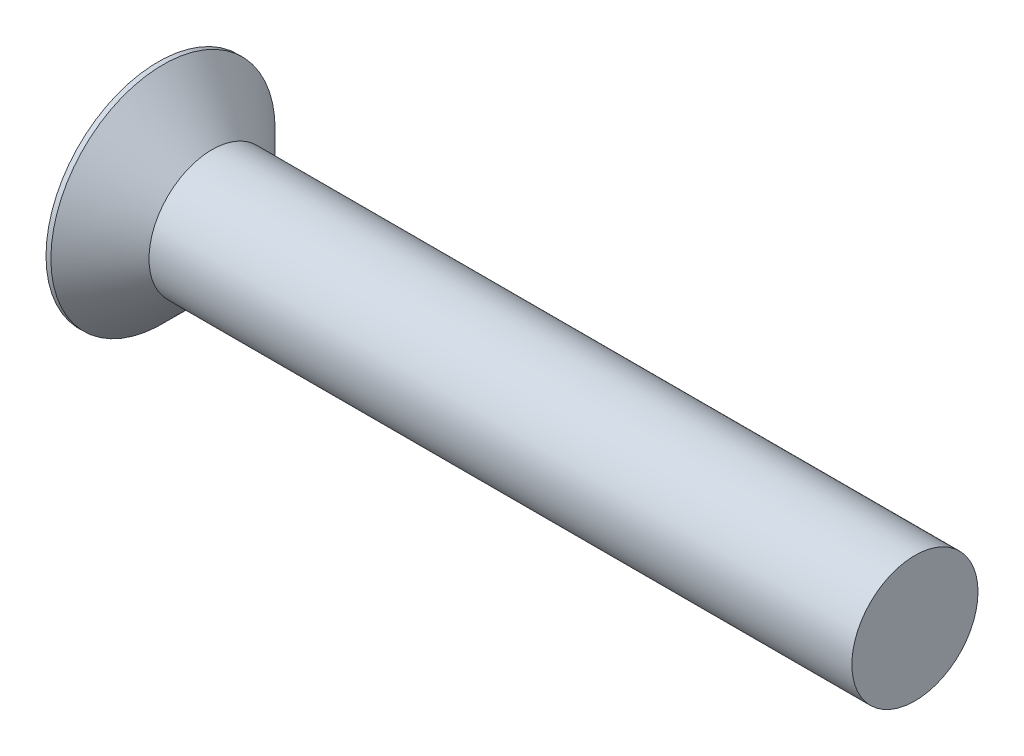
ISO-10303-21;
HEADER;
FILE_DESCRIPTION(('STEP AP214'),'2;1');
FILE_NAME('part.step','',(''),(''),'','','');
FILE_SCHEMA(('AUTOMOTIVE_DESIGN { 1 0 10303 214 1 1 1 1 }'));
ENDSEC;
DATA;
#1=APPLICATION_CONTEXT('core data for automotive mechanical design processes');
#2=APPLICATION_PROTOCOL_DEFINITION('international standard','automotive_design',2000,#1);
#3=PRODUCT_CONTEXT('',#1,'mechanical');
#4=PRODUCT('Part','Part','',(#3));
#5=PRODUCT_RELATED_PRODUCT_CATEGORY('part','',(#4));
#6=PRODUCT_DEFINITION_FORMATION('','',#4);
#7=PRODUCT_DEFINITION_CONTEXT('part definition',#1,'design');
#8=PRODUCT_DEFINITION('design','',#6,#7);
#9=PRODUCT_DEFINITION_SHAPE('','',#8);
#10=(LENGTH_UNIT() NAMED_UNIT(*) SI_UNIT(.MILLI.,.METRE.));
#11=(NAMED_UNIT(*) PLANE_ANGLE_UNIT() SI_UNIT($,.RADIAN.));
#12=(NAMED_UNIT(*) SI_UNIT($,.STERADIAN.) SOLID_ANGLE_UNIT());
#13=UNCERTAINTY_MEASURE_WITH_UNIT(LENGTH_MEASURE(1.E-05),#10,'distance_accuracy_value','');
#14=(GEOMETRIC_REPRESENTATION_CONTEXT(3) GLOBAL_UNCERTAINTY_ASSIGNED_CONTEXT((#13)) GLOBAL_UNIT_ASSIGNED_CONTEXT((#10,
#11,#12)) REPRESENTATION_CONTEXT('',''));
#15=CARTESIAN_POINT('',(0.,0.,0.));
#16=DIRECTION('',(0.,0.,1.));
#17=DIRECTION('',(1.,0.,0.));
#18=AXIS2_PLACEMENT_3D('',#15,#16,#17);
#19=CARTESIAN_POINT('',(60.,5.00000000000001,0.));
#20=DIRECTION('',(1.,0.,0.));
#21=DIRECTION('',(0.,0.,-1.));
#22=AXIS2_PLACEMENT_3D('',#19,#20,#21);
#23=PLANE('',#22);
#24=CARTESIAN_POINT('',(60.,0.,0.));
#25=DIRECTION('',(1.,0.,0.));
#26=DIRECTION('',(0.,0.,-1.));
#27=AXIS2_PLACEMENT_3D('',#24,#25,#26);
#28=CIRCLE('',#27,5.00000000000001);
#29=CARTESIAN_POINT('',(60.,0.,-5.00000000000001));
#30=VERTEX_POINT('',#29);
#31=EDGE_CURVE('E355',#30,#30,#28,.T.);
#32=ORIENTED_EDGE('',*,*,#31,.T.);
#33=EDGE_LOOP('',(#32));
#34=FACE_BOUND('',#33,.T.);
#35=ADVANCED_FACE('F35',(#34),#23,.T.);
#36=CARTESIAN_POINT('',(16.0308913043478,0.,0.));
#37=DIRECTION('',(0.,0.,1.));
#38=DIRECTION('',(1.,0.,0.));
#39=AXIS2_PLACEMENT_3D('',#36,#37,#38);
#40=SPHERICAL_SURFACE('',#39,18.3308913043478);
#41=CARTESIAN_POINT('',(14.3024985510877,-2.37436003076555,-4.11251220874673));
#42=DIRECTION('',(0.342020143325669,0.469846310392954,0.813797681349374));
#43=DIRECTION('',(0.,-0.866025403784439,0.5));
#44=AXIS2_PLACEMENT_3D('',#41,#42,#43);
#45=CIRCLE('',#44,17.6205531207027);
#46=CARTESIAN_POINT('',(-1.79199245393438,-3.03037873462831,3.03037873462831));
#47=VERTEX_POINT('',#46);
#48=CARTESIAN_POINT('',(-2.16161966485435,-1.,2.01348470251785));
#49=VERTEX_POINT('',#48);
#50=EDGE_CURVE('E327',#47,#49,#45,.F.);
#51=ORIENTED_EDGE('',*,*,#50,.F.);
#52=CARTESIAN_POINT('',(14.3024985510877,4.11251220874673,2.37436003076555));
#53=DIRECTION('',(0.342020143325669,-0.813797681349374,-0.469846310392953));
#54=DIRECTION('',(0.,0.499999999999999,-0.866025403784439));
#55=AXIS2_PLACEMENT_3D('',#52,#53,#54);
#56=CIRCLE('',#55,17.6205531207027);
#57=CARTESIAN_POINT('',(-2.16161966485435,-2.01348470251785,1.));
#58=VERTEX_POINT('',#57);
#59=EDGE_CURVE('E321',#58,#47,#56,.F.);
#60=ORIENTED_EDGE('',*,*,#59,.F.);
#61=CARTESIAN_POINT('',(16.0308913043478,0.,1.));
#62=DIRECTION('',(0.,0.,1.));
#63=DIRECTION('',(1.,0.,0.));
#64=AXIS2_PLACEMENT_3D('',#61,#62,#63);
#65=CIRCLE('',#64,18.3035946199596);
#66=CARTESIAN_POINT('',(-1.67502992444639,-4.63917335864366,1.));
#67=VERTEX_POINT('',#66);
#68=EDGE_CURVE('E386',#67,#58,#65,.F.);
#69=ORIENTED_EDGE('',*,*,#68,.F.);
#70=CARTESIAN_POINT('',(13.613231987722,4.18750877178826,0.));
#71=DIRECTION('',(-0.500000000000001,0.866025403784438,0.));
#72=DIRECTION('',(-0.866025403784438,-0.500000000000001,0.));
#73=AXIS2_PLACEMENT_3D('',#70,#71,#72);
#74=CIRCLE('',#73,17.6816647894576);
#75=CARTESIAN_POINT('',(-1.67502992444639,-4.63917335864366,-0.999999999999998));
#76=VERTEX_POINT('',#75);
#77=EDGE_CURVE('E390',#76,#67,#74,.T.);
#78=ORIENTED_EDGE('',*,*,#77,.F.);
#79=CARTESIAN_POINT('',(16.0308913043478,0.,-0.999999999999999));
#80=DIRECTION('',(0.,0.,-1.));
#81=DIRECTION('',(0.,1.,0.));
#82=AXIS2_PLACEMENT_3D('',#79,#80,#81);
#83=CIRCLE('',#82,18.3035946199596);
#84=CARTESIAN_POINT('',(-2.16161966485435,-2.01348470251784,-0.999999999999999));
#85=VERTEX_POINT('',#84);
#86=EDGE_CURVE('E376',#85,#76,#83,.F.);
#87=ORIENTED_EDGE('',*,*,#86,.F.);
#88=CARTESIAN_POINT('',(14.3024985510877,4.11251220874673,-2.37436003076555));
#89=DIRECTION('',(0.342020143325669,-0.813797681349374,0.469846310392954));
#90=DIRECTION('',(0.,-0.5,-0.866025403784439));
#91=AXIS2_PLACEMENT_3D('',#88,#89,#90);
#92=CIRCLE('',#91,17.6205531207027);
#93=CARTESIAN_POINT('',(-1.79199245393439,-3.03037873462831,-3.03037873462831));
#94=VERTEX_POINT('',#93);
#95=EDGE_CURVE('E315',#94,#85,#92,.F.);
#96=ORIENTED_EDGE('',*,*,#95,.F.);
#97=CARTESIAN_POINT('',(14.3024985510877,-2.37436003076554,4.11251220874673));
#98=DIRECTION('',(0.342020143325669,0.469846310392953,-0.813797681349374));
#99=DIRECTION('',(0.,0.866025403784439,0.499999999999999));
#100=AXIS2_PLACEMENT_3D('',#97,#98,#99);
#101=CIRCLE('',#100,17.6205531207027);
#102=CARTESIAN_POINT('',(-2.16161966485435,-1.,-2.01348470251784));
#103=VERTEX_POINT('',#102);
#104=EDGE_CURVE('E309',#103,#94,#101,.F.);
#105=ORIENTED_EDGE('',*,*,#104,.F.);
#106=CARTESIAN_POINT('',(16.0308913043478,-1.,0.));
#107=DIRECTION('',(0.,-1.,0.));
#108=DIRECTION('',(0.,0.,-1.));
#109=AXIS2_PLACEMENT_3D('',#106,#107,#108);
#110=CIRCLE('',#109,18.3035946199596);
#111=CARTESIAN_POINT('',(-1.67502992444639,-1.,-4.63917335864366));
#112=VERTEX_POINT('',#111);
#113=EDGE_CURVE('E373',#112,#103,#110,.F.);
#114=ORIENTED_EDGE('',*,*,#113,.F.);
#115=CARTESIAN_POINT('',(13.613231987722,0.,4.18750877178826));
#116=DIRECTION('',(-0.500000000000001,0.,0.866025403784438));
#117=DIRECTION('',(0.866025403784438,0.,0.500000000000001));
#118=AXIS2_PLACEMENT_3D('',#115,#116,#117);
#119=CIRCLE('',#118,17.6816647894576);
#120=CARTESIAN_POINT('',(-1.67502992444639,0.999999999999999,-4.63917335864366));
#121=VERTEX_POINT('',#120);
#122=EDGE_CURVE('E368',#121,#112,#119,.T.);
#123=ORIENTED_EDGE('',*,*,#122,.F.);
#124=CARTESIAN_POINT('',(16.0308913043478,1.,0.));
#125=DIRECTION('',(0.,1.,0.));
#126=DIRECTION('',(0.,0.,1.));
#127=AXIS2_PLACEMENT_3D('',#124,#125,#126);
#128=CIRCLE('',#127,18.3035946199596);
#129=CARTESIAN_POINT('',(-2.16161966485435,0.999999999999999,-2.01348470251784));
#130=VERTEX_POINT('',#129);
#131=EDGE_CURVE('E369',#130,#121,#128,.F.);
#132=ORIENTED_EDGE('',*,*,#131,.F.);
#133=CARTESIAN_POINT('',(14.3024985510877,2.37436003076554,4.11251220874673));
#134=DIRECTION('',(0.342020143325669,-0.469846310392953,-0.813797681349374));
#135=DIRECTION('',(0.,0.866025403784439,-0.499999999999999));
#136=AXIS2_PLACEMENT_3D('',#133,#134,#135);
#137=CIRCLE('',#136,17.6205531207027);
#138=CARTESIAN_POINT('',(-1.79199245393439,3.03037873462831,-3.0303787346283));
#139=VERTEX_POINT('',#138);
#140=EDGE_CURVE('E303',#139,#130,#137,.F.);
#141=ORIENTED_EDGE('',*,*,#140,.F.);
#142=CARTESIAN_POINT('',(14.3024985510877,-4.11251220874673,-2.37436003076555));
#143=DIRECTION('',(0.342020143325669,0.813797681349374,0.469846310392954));
#144=DIRECTION('',(0.,-0.5,0.866025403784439));
#145=AXIS2_PLACEMENT_3D('',#142,#143,#144);
#146=CIRCLE('',#145,17.6205531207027);
#147=CARTESIAN_POINT('',(-2.16161966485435,2.01348470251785,-1.));
#148=VERTEX_POINT('',#147);
#149=EDGE_CURVE('E297',#148,#139,#146,.F.);
#150=ORIENTED_EDGE('',*,*,#149,.F.);
#151=CARTESIAN_POINT('',(16.0308913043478,0.,-1.));
#152=DIRECTION('',(0.,0.,-1.));
#153=DIRECTION('',(0.,1.,0.));
#154=AXIS2_PLACEMENT_3D('',#151,#152,#153);
#155=CIRCLE('',#154,18.3035946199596);
#156=CARTESIAN_POINT('',(-1.67502992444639,4.63917335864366,-1.));
#157=VERTEX_POINT('',#156);
#158=EDGE_CURVE('E372',#157,#148,#155,.F.);
#159=ORIENTED_EDGE('',*,*,#158,.F.);
#160=CARTESIAN_POINT('',(13.613231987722,-4.18750877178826,0.));
#161=DIRECTION('',(-0.500000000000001,-0.866025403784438,0.));
#162=DIRECTION('',(0.866025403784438,-0.500000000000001,0.));
#163=AXIS2_PLACEMENT_3D('',#160,#161,#162);
#164=CIRCLE('',#163,17.6816647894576);
#165=CARTESIAN_POINT('',(-1.67502992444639,4.63917335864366,1.));
#166=VERTEX_POINT('',#165);
#167=EDGE_CURVE('E379',#166,#157,#164,.T.);
#168=ORIENTED_EDGE('',*,*,#167,.F.);
#169=CARTESIAN_POINT('',(16.0308913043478,0.,1.));
#170=DIRECTION('',(0.,0.,1.));
#171=DIRECTION('',(1.,0.,0.));
#172=AXIS2_PLACEMENT_3D('',#169,#170,#171);
#173=CIRCLE('',#172,18.3035946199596);
#174=CARTESIAN_POINT('',(-2.16161966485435,2.01348470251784,1.));
#175=VERTEX_POINT('',#174);
#176=EDGE_CURVE('E377',#175,#166,#173,.F.);
#177=ORIENTED_EDGE('',*,*,#176,.F.);
#178=CARTESIAN_POINT('',(14.3024985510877,-4.11251220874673,2.37436003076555));
#179=DIRECTION('',(0.342020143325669,0.813797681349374,-0.469846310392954));
#180=DIRECTION('',(0.,0.5,0.866025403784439));
#181=AXIS2_PLACEMENT_3D('',#178,#179,#180);
#182=CIRCLE('',#181,17.6205531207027);
#183=CARTESIAN_POINT('',(-1.79199245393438,3.03037873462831,3.03037873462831));
#184=VERTEX_POINT('',#183);
#185=EDGE_CURVE('E291',#184,#175,#182,.F.);
#186=ORIENTED_EDGE('',*,*,#185,.F.);
#187=CARTESIAN_POINT('',(14.3024985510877,2.37436003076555,-4.11251220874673));
#188=DIRECTION('',(0.342020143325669,-0.469846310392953,0.813797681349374));
#189=DIRECTION('',(0.,-0.866025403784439,-0.499999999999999));
#190=AXIS2_PLACEMENT_3D('',#187,#188,#189);
#191=CIRCLE('',#190,17.6205531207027);
#192=CARTESIAN_POINT('',(-2.16161966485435,1.,2.01348470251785));
#193=VERTEX_POINT('',#192);
#194=EDGE_CURVE('E283',#193,#184,#191,.F.);
#195=ORIENTED_EDGE('',*,*,#194,.F.);
#196=CARTESIAN_POINT('',(16.0308913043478,1.,0.));
#197=DIRECTION('',(0.,1.,0.));
#198=DIRECTION('',(0.,0.,1.));
#199=AXIS2_PLACEMENT_3D('',#196,#197,#198);
#200=CIRCLE('',#199,18.3035946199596);
#201=CARTESIAN_POINT('',(-1.67502992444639,1.,4.63917335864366));
#202=VERTEX_POINT('',#201);
#203=EDGE_CURVE('E380',#202,#193,#200,.F.);
#204=ORIENTED_EDGE('',*,*,#203,.F.);
#205=CARTESIAN_POINT('',(13.613231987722,0.,-4.18750877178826));
#206=DIRECTION('',(-0.500000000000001,0.,-0.866025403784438));
#207=DIRECTION('',(-0.866025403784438,0.,0.500000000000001));
#208=AXIS2_PLACEMENT_3D('',#205,#206,#207);
#209=CIRCLE('',#208,17.6816647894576);
#210=CARTESIAN_POINT('',(-1.67502992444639,-1.,4.63917335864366));
#211=VERTEX_POINT('',#210);
#212=EDGE_CURVE('E385',#211,#202,#209,.T.);
#213=ORIENTED_EDGE('',*,*,#212,.F.);
#214=CARTESIAN_POINT('',(16.0308913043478,-1.,0.));
#215=DIRECTION('',(0.,-1.,0.));
#216=DIRECTION('',(0.,0.,-1.));
#217=AXIS2_PLACEMENT_3D('',#214,#215,#216);
#218=CIRCLE('',#217,18.3035946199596);
#219=EDGE_CURVE('E383',#49,#211,#218,.F.);
#220=ORIENTED_EDGE('',*,*,#219,.F.);
#221=EDGE_LOOP('',(#51,#60,#69,#78,#87,#96,#105,#114,#123,#132,#141,#150,#159,#168,#177,#186,
#195,#204,#213,#220));
#222=FACE_BOUND('',#221,.T.);
#223=CARTESIAN_POINT('',(0.,0.,0.));
#224=DIRECTION('',(1.,0.,0.));
#225=DIRECTION('',(0.,0.,-1.));
#226=AXIS2_PLACEMENT_3D('',#223,#224,#225);
#227=CIRCLE('',#226,8.89);
#228=CARTESIAN_POINT('',(0.,0.,-8.89));
#229=VERTEX_POINT('',#228);
#230=EDGE_CURVE('E365',#229,#229,#227,.T.);
#231=ORIENTED_EDGE('',*,*,#230,.F.);
#232=EDGE_LOOP('',(#231));
#233=FACE_BOUND('',#232,.T.);
#234=ADVANCED_FACE('F547',(#222,#233),#40,.T.);
#235=CARTESIAN_POINT('',(4.51581291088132,0.,0.));
#236=DIRECTION('',(1.,0.,0.));
#237=DIRECTION('',(0.,0.,-1.));
#238=AXIS2_PLACEMENT_3D('',#235,#236,#237);
#239=CYLINDRICAL_SURFACE('',#238,8.89);
#240=ORIENTED_EDGE('',*,*,#230,.T.);
#241=EDGE_LOOP('',(#240));
#242=FACE_BOUND('',#241,.T.);
#243=CARTESIAN_POINT('',(0.385867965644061,0.,0.));
#244=DIRECTION('',(1.,0.,0.));
#245=DIRECTION('',(0.,0.,-1.));
#246=AXIS2_PLACEMENT_3D('',#243,#244,#245);
#247=CIRCLE('',#246,8.88999999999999);
#248=CARTESIAN_POINT('',(0.385867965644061,0.,-8.88999999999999));
#249=VERTEX_POINT('',#248);
#250=EDGE_CURVE('E362',#249,#249,#247,.T.);
#251=ORIENTED_EDGE('',*,*,#250,.F.);
#252=EDGE_LOOP('',(#251));
#253=FACE_BOUND('',#252,.T.);
#254=ADVANCED_FACE('F579',(#242,#253),#239,.T.);
#255=CARTESIAN_POINT('',(4.27586796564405,0.,0.));
#256=DIRECTION('',(-1.,0.,0.));
#257=DIRECTION('',(0.,0.,1.));
#258=AXIS2_PLACEMENT_3D('',#255,#256,#257);
#259=CONICAL_SURFACE('',#258,4.99999999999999,0.78539816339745);
#260=ORIENTED_EDGE('',*,*,#250,.T.);
#261=EDGE_LOOP('',(#260));
#262=FACE_BOUND('',#261,.T.);
#263=CARTESIAN_POINT('',(4.27586796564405,0.,0.));
#264=DIRECTION('',(1.,0.,0.));
#265=DIRECTION('',(0.,0.,-1.));
#266=AXIS2_PLACEMENT_3D('',#263,#264,#265);
#267=CIRCLE('',#266,4.99999999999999);
#268=CARTESIAN_POINT('',(4.27586796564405,0.,-4.99999999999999));
#269=VERTEX_POINT('',#268);
#270=EDGE_CURVE('E358',#269,#269,#267,.T.);
#271=ORIENTED_EDGE('',*,*,#270,.F.);
#272=EDGE_LOOP('',(#271));
#273=FACE_BOUND('',#272,.T.);
#274=ADVANCED_FACE('F743',(#262,#273),#259,.T.);
#275=CARTESIAN_POINT('',(4.51581291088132,0.,0.));
#276=DIRECTION('',(1.,0.,0.));
#277=DIRECTION('',(0.,0.,-1.));
#278=AXIS2_PLACEMENT_3D('',#275,#276,#277);
#279=CYLINDRICAL_SURFACE('',#278,5.);
#280=ORIENTED_EDGE('',*,*,#270,.T.);
#281=EDGE_LOOP('',(#280));
#282=FACE_BOUND('',#281,.T.);
#283=ORIENTED_EDGE('',*,*,#31,.F.);
#284=EDGE_LOOP('',(#283));
#285=FACE_BOUND('',#284,.T.);
#286=ADVANCED_FACE('F741',(#282,#285),#279,.T.);
#287=CARTESIAN_POINT('',(0.2,1.,-1.));
#288=DIRECTION('',(0.,1.,0.));
#289=DIRECTION('',(0.,0.,1.));
#290=AXIS2_PLACEMENT_3D('',#287,#288,#289);
#291=PLANE('',#290);
#292=DIRECTION('',(-1.,0.,0.));
#293=VECTOR('',#292,1.);
#294=CARTESIAN_POINT('',(0.2,1.,-1.3));
#295=LINE('',#294,#293);
#296=CARTESIAN_POINT('',(0.2,1.,-1.3));
#297=VERTEX_POINT('',#296);
#298=CARTESIAN_POINT('',(-0.463964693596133,1.,-1.3));
#299=VERTEX_POINT('',#298);
#300=EDGE_CURVE('E436',#297,#299,#295,.T.);
#301=ORIENTED_EDGE('',*,*,#300,.T.);
#302=DIRECTION('',(-0.921891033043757,0.,-0.387449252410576));
#303=VECTOR('',#302,1.);
#304=CARTESIAN_POINT('',(0.207483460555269,1.,-1.01780603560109));
#305=LINE('',#304,#303);
#306=EDGE_CURVE('E300',#299,#130,#305,.T.);
#307=ORIENTED_EDGE('',*,*,#306,.T.);
#308=ORIENTED_EDGE('',*,*,#131,.T.);
#309=DIRECTION('',(0.866025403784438,0.,0.500000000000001));
#310=VECTOR('',#309,1.);
#311=CARTESIAN_POINT('',(1.30705080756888,0.999999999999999,-2.91746824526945));
#312=LINE('',#311,#310);
#313=CARTESIAN_POINT('',(0.2,0.999999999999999,-3.55662432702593));
#314=VERTEX_POINT('',#313);
#315=EDGE_CURVE('E354',#314,#121,#312,.F.);
#316=ORIENTED_EDGE('',*,*,#315,.F.);
#317=DIRECTION('',(0.,0.,-1.));
#318=VECTOR('',#317,1.);
#319=CARTESIAN_POINT('',(0.2,1.,-1.));
#320=LINE('',#319,#318);
#321=EDGE_CURVE('E330',#297,#314,#320,.T.);
#322=ORIENTED_EDGE('',*,*,#321,.F.);
#323=EDGE_LOOP('',(#301,#307,#308,#316,#322));
#324=FACE_BOUND('',#323,.T.);
#325=ADVANCED_FACE('F521',(#324),#291,.F.);
#326=CARTESIAN_POINT('',(0.2,1.,-1.));
#327=DIRECTION('',(0.,0.,-1.));
#328=DIRECTION('',(0.,1.,0.));
#329=AXIS2_PLACEMENT_3D('',#326,#327,#328);
#330=PLANE('',#329);
#331=ORIENTED_EDGE('',*,*,#158,.T.);
#332=DIRECTION('',(0.921891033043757,-0.387449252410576,0.));
#333=VECTOR('',#332,1.);
#334=CARTESIAN_POINT('',(0.207483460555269,1.01780603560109,-1.));
#335=LINE('',#334,#333);
#336=CARTESIAN_POINT('',(-0.463964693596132,1.3,-1.));
#337=VERTEX_POINT('',#336);
#338=EDGE_CURVE('E294',#148,#337,#335,.T.);
#339=ORIENTED_EDGE('',*,*,#338,.T.);
#340=DIRECTION('',(-1.,0.,0.));
#341=VECTOR('',#340,1.);
#342=CARTESIAN_POINT('',(0.2,1.3,-1.));
#343=LINE('',#342,#341);
#344=CARTESIAN_POINT('',(0.2,1.3,-1.));
#345=VERTEX_POINT('',#344);
#346=EDGE_CURVE('E439',#337,#345,#343,.F.);
#347=ORIENTED_EDGE('',*,*,#346,.T.);
#348=DIRECTION('',(0.,-1.,0.));
#349=VECTOR('',#348,1.);
#350=CARTESIAN_POINT('',(0.2,1.,-1.));
#351=LINE('',#350,#349);
#352=CARTESIAN_POINT('',(0.2,3.55662432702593,-1.));
#353=VERTEX_POINT('',#352);
#354=EDGE_CURVE('E351',#353,#345,#351,.T.);
#355=ORIENTED_EDGE('',*,*,#354,.F.);
#356=DIRECTION('',(0.866025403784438,-0.500000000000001,0.));
#357=VECTOR('',#356,1.);
#358=CARTESIAN_POINT('',(-2.3,5.,-1.));
#359=LINE('',#358,#357);
#360=EDGE_CURVE('E359',#353,#157,#359,.F.);
#361=ORIENTED_EDGE('',*,*,#360,.T.);
#362=EDGE_LOOP('',(#331,#339,#347,#355,#361));
#363=FACE_BOUND('',#362,.T.);
#364=ADVANCED_FACE('F510',(#363),#330,.F.);
#365=CARTESIAN_POINT('',(-2.3,5.,0.));
#366=DIRECTION('',(-0.500000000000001,-0.866025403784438,0.));
#367=DIRECTION('',(0.866025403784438,-0.500000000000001,0.));
#368=AXIS2_PLACEMENT_3D('',#365,#366,#367);
#369=PLANE('',#368);
#370=ORIENTED_EDGE('',*,*,#167,.T.);
#371=ORIENTED_EDGE('',*,*,#360,.F.);
#372=DIRECTION('',(0.,0.,1.));
#373=VECTOR('',#372,1.);
#374=CARTESIAN_POINT('',(0.2,3.55662432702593,-1.));
#375=LINE('',#374,#373);
#376=CARTESIAN_POINT('',(0.2,3.55662432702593,1.));
#377=VERTEX_POINT('',#376);
#378=EDGE_CURVE('E350',#377,#353,#375,.F.);
#379=ORIENTED_EDGE('',*,*,#378,.F.);
#380=DIRECTION('',(0.866025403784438,-0.500000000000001,0.));
#381=VECTOR('',#380,1.);
#382=CARTESIAN_POINT('',(1.30705080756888,2.91746824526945,1.));
#383=LINE('',#382,#381);
#384=EDGE_CURVE('E403',#377,#166,#383,.F.);
#385=ORIENTED_EDGE('',*,*,#384,.T.);
#386=EDGE_LOOP('',(#370,#371,#379,#385));
#387=FACE_BOUND('',#386,.T.);
#388=ADVANCED_FACE('F591',(#387),#369,.T.);
#389=CARTESIAN_POINT('',(0.2,1.,1.));
#390=DIRECTION('',(0.,0.,1.));
#391=DIRECTION('',(1.,0.,0.));
#392=AXIS2_PLACEMENT_3D('',#389,#390,#391);
#393=PLANE('',#392);
#394=DIRECTION('',(-1.,0.,0.));
#395=VECTOR('',#394,1.);
#396=CARTESIAN_POINT('',(0.2,1.3,1.));
#397=LINE('',#396,#395);
#398=CARTESIAN_POINT('',(0.2,1.3,1.));
#399=VERTEX_POINT('',#398);
#400=CARTESIAN_POINT('',(-0.463964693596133,1.3,1.));
#401=VERTEX_POINT('',#400);
#402=EDGE_CURVE('E441',#399,#401,#397,.T.);
#403=ORIENTED_EDGE('',*,*,#402,.T.);
#404=DIRECTION('',(-0.921891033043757,0.387449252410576,0.));
#405=VECTOR('',#404,1.);
#406=CARTESIAN_POINT('',(0.207483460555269,1.01780603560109,1.));
#407=LINE('',#406,#405);
#408=EDGE_CURVE('E288',#401,#175,#407,.T.);
#409=ORIENTED_EDGE('',*,*,#408,.T.);
#410=ORIENTED_EDGE('',*,*,#176,.T.);
#411=ORIENTED_EDGE('',*,*,#384,.F.);
#412=DIRECTION('',(0.,1.,0.));
#413=VECTOR('',#412,1.);
#414=CARTESIAN_POINT('',(0.2,1.,1.));
#415=LINE('',#414,#413);
#416=EDGE_CURVE('E348',#399,#377,#415,.T.);
#417=ORIENTED_EDGE('',*,*,#416,.F.);
#418=EDGE_LOOP('',(#403,#409,#410,#411,#417));
#419=FACE_BOUND('',#418,.T.);
#420=ADVANCED_FACE('F502',(#419),#393,.F.);
#421=CARTESIAN_POINT('',(0.2,1.,1.));
#422=DIRECTION('',(0.,1.,0.));
#423=DIRECTION('',(0.,0.,1.));
#424=AXIS2_PLACEMENT_3D('',#421,#422,#423);
#425=PLANE('',#424);
#426=ORIENTED_EDGE('',*,*,#203,.T.);
#427=DIRECTION('',(0.921891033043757,0.,-0.387449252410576));
#428=VECTOR('',#427,1.);
#429=CARTESIAN_POINT('',(0.207483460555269,1.,1.01780603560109));
#430=LINE('',#429,#428);
#431=CARTESIAN_POINT('',(-0.463964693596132,1.,1.3));
#432=VERTEX_POINT('',#431);
#433=EDGE_CURVE('E280',#193,#432,#430,.T.);
#434=ORIENTED_EDGE('',*,*,#433,.T.);
#435=DIRECTION('',(-1.,0.,0.));
#436=VECTOR('',#435,1.);
#437=CARTESIAN_POINT('',(0.2,1.,1.3));
#438=LINE('',#437,#436);
#439=CARTESIAN_POINT('',(0.2,1.,1.3));
#440=VERTEX_POINT('',#439);
#441=EDGE_CURVE('E444',#432,#440,#438,.F.);
#442=ORIENTED_EDGE('',*,*,#441,.T.);
#443=DIRECTION('',(0.,0.,-1.));
#444=VECTOR('',#443,1.);
#445=CARTESIAN_POINT('',(0.2,1.,1.));
#446=LINE('',#445,#444);
#447=CARTESIAN_POINT('',(0.2,1.,3.55662432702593));
#448=VERTEX_POINT('',#447);
#449=EDGE_CURVE('E345',#448,#440,#446,.T.);
#450=ORIENTED_EDGE('',*,*,#449,.F.);
#451=DIRECTION('',(0.866025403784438,0.,-0.500000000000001));
#452=VECTOR('',#451,1.);
#453=CARTESIAN_POINT('',(-2.3,1.,5.));
#454=LINE('',#453,#452);
#455=EDGE_CURVE('E406',#448,#202,#454,.F.);
#456=ORIENTED_EDGE('',*,*,#455,.T.);
#457=EDGE_LOOP('',(#426,#434,#442,#450,#456));
#458=FACE_BOUND('',#457,.T.);
#459=ADVANCED_FACE('F553',(#458),#425,.F.);
#460=CARTESIAN_POINT('',(-2.3,0.,5.));
#461=DIRECTION('',(-0.500000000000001,0.,-0.866025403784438));
#462=DIRECTION('',(-0.866025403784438,0.,0.500000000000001));
#463=AXIS2_PLACEMENT_3D('',#460,#461,#462);
#464=PLANE('',#463);
#465=ORIENTED_EDGE('',*,*,#212,.T.);
#466=ORIENTED_EDGE('',*,*,#455,.F.);
#467=DIRECTION('',(0.,-1.,0.));
#468=VECTOR('',#467,1.);
#469=CARTESIAN_POINT('',(0.2,1.,3.55662432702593));
#470=LINE('',#469,#468);
#471=CARTESIAN_POINT('',(0.2,-1.,3.55662432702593));
#472=VERTEX_POINT('',#471);
#473=EDGE_CURVE('E344',#472,#448,#470,.F.);
#474=ORIENTED_EDGE('',*,*,#473,.F.);
#475=DIRECTION('',(0.866025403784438,0.,-0.500000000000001));
#476=VECTOR('',#475,1.);
#477=CARTESIAN_POINT('',(1.30705080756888,-1.,2.91746824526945));
#478=LINE('',#477,#476);
#479=EDGE_CURVE('E412',#472,#211,#478,.F.);
#480=ORIENTED_EDGE('',*,*,#479,.T.);
#481=EDGE_LOOP('',(#465,#466,#474,#480));
#482=FACE_BOUND('',#481,.T.);
#483=ADVANCED_FACE('F491',(#482),#464,.T.);
#484=CARTESIAN_POINT('',(0.2,-1.,1.));
#485=DIRECTION('',(0.,-1.,0.));
#486=DIRECTION('',(0.,0.,-1.));
#487=AXIS2_PLACEMENT_3D('',#484,#485,#486);
#488=PLANE('',#487);
#489=DIRECTION('',(-1.,0.,0.));
#490=VECTOR('',#489,1.);
#491=CARTESIAN_POINT('',(0.2,-1.,1.3));
#492=LINE('',#491,#490);
#493=CARTESIAN_POINT('',(0.2,-1.,1.3));
#494=VERTEX_POINT('',#493);
#495=CARTESIAN_POINT('',(-0.463964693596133,-1.,1.3));
#496=VERTEX_POINT('',#495);
#497=EDGE_CURVE('E371',#494,#496,#492,.T.);
#498=ORIENTED_EDGE('',*,*,#497,.T.);
#499=DIRECTION('',(-0.921891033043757,0.,0.387449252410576));
#500=VECTOR('',#499,1.);
#501=CARTESIAN_POINT('',(0.207483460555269,-1.,1.01780603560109));
#502=LINE('',#501,#500);
#503=EDGE_CURVE('E324',#496,#49,#502,.T.);
#504=ORIENTED_EDGE('',*,*,#503,.T.);
#505=ORIENTED_EDGE('',*,*,#219,.T.);
#506=ORIENTED_EDGE('',*,*,#479,.F.);
#507=DIRECTION('',(0.,0.,1.));
#508=VECTOR('',#507,1.);
#509=CARTESIAN_POINT('',(0.2,-1.,1.));
#510=LINE('',#509,#508);
#511=EDGE_CURVE('E342',#494,#472,#510,.T.);
#512=ORIENTED_EDGE('',*,*,#511,.F.);
#513=EDGE_LOOP('',(#498,#504,#505,#506,#512));
#514=FACE_BOUND('',#513,.T.);
#515=ADVANCED_FACE('F486',(#514),#488,.F.);
#516=CARTESIAN_POINT('',(0.2,-1.,1.));
#517=DIRECTION('',(0.,0.,1.));
#518=DIRECTION('',(1.,0.,0.));
#519=AXIS2_PLACEMENT_3D('',#516,#517,#518);
#520=PLANE('',#519);
#521=ORIENTED_EDGE('',*,*,#68,.T.);
#522=DIRECTION('',(0.921891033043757,0.387449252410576,0.));
#523=VECTOR('',#522,1.);
#524=CARTESIAN_POINT('',(0.207483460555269,-1.01780603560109,1.));
#525=LINE('',#524,#523);
#526=CARTESIAN_POINT('',(-0.463964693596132,-1.3,1.));
#527=VERTEX_POINT('',#526);
#528=EDGE_CURVE('E318',#58,#527,#525,.T.);
#529=ORIENTED_EDGE('',*,*,#528,.T.);
#530=DIRECTION('',(-1.,0.,0.));
#531=VECTOR('',#530,1.);
#532=CARTESIAN_POINT('',(0.2,-1.3,1.));
#533=LINE('',#532,#531);
#534=CARTESIAN_POINT('',(0.2,-1.3,1.));
#535=VERTEX_POINT('',#534);
#536=EDGE_CURVE('E429',#527,#535,#533,.F.);
#537=ORIENTED_EDGE('',*,*,#536,.T.);
#538=DIRECTION('',(0.,1.,0.));
#539=VECTOR('',#538,1.);
#540=CARTESIAN_POINT('',(0.2,-1.,1.));
#541=LINE('',#540,#539);
#542=CARTESIAN_POINT('',(0.2,-3.55662432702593,1.));
#543=VERTEX_POINT('',#542);
#544=EDGE_CURVE('E339',#543,#535,#541,.T.);
#545=ORIENTED_EDGE('',*,*,#544,.F.);
#546=DIRECTION('',(0.866025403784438,0.500000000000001,0.));
#547=VECTOR('',#546,1.);
#548=CARTESIAN_POINT('',(-2.3,-5.,1.));
#549=LINE('',#548,#547);
#550=EDGE_CURVE('E415',#543,#67,#549,.F.);
#551=ORIENTED_EDGE('',*,*,#550,.T.);
#552=EDGE_LOOP('',(#521,#529,#537,#545,#551));
#553=FACE_BOUND('',#552,.T.);
#554=ADVANCED_FACE('F475',(#553),#520,.F.);
#555=CARTESIAN_POINT('',(-2.3,-5.,0.));
#556=DIRECTION('',(-0.500000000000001,0.866025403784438,0.));
#557=DIRECTION('',(-0.866025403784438,-0.500000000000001,0.));
#558=AXIS2_PLACEMENT_3D('',#555,#556,#557);
#559=PLANE('',#558);
#560=ORIENTED_EDGE('',*,*,#77,.T.);
#561=ORIENTED_EDGE('',*,*,#550,.F.);
#562=DIRECTION('',(0.,0.,-1.));
#563=VECTOR('',#562,1.);
#564=CARTESIAN_POINT('',(0.2,-3.55662432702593,-1.));
#565=LINE('',#564,#563);
#566=CARTESIAN_POINT('',(0.2,-3.55662432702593,-0.999999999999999));
#567=VERTEX_POINT('',#566);
#568=EDGE_CURVE('E338',#567,#543,#565,.F.);
#569=ORIENTED_EDGE('',*,*,#568,.F.);
#570=DIRECTION('',(0.866025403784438,0.500000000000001,0.));
#571=VECTOR('',#570,1.);
#572=CARTESIAN_POINT('',(1.30705080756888,-2.91746824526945,-0.999999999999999));
#573=LINE('',#572,#571);
#574=EDGE_CURVE('E401',#567,#76,#573,.F.);
#575=ORIENTED_EDGE('',*,*,#574,.T.);
#576=EDGE_LOOP('',(#560,#561,#569,#575));
#577=FACE_BOUND('',#576,.T.);
#578=ADVANCED_FACE('F543',(#577),#559,.T.);
#579=CARTESIAN_POINT('',(0.2,-1.,-0.999999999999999));
#580=DIRECTION('',(0.,0.,-1.));
#581=DIRECTION('',(0.,1.,0.));
#582=AXIS2_PLACEMENT_3D('',#579,#580,#581);
#583=PLANE('',#582);
#584=DIRECTION('',(-1.,0.,0.));
#585=VECTOR('',#584,1.);
#586=CARTESIAN_POINT('',(0.2,-1.3,-0.999999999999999));
#587=LINE('',#586,#585);
#588=CARTESIAN_POINT('',(0.2,-1.3,-0.999999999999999));
#589=VERTEX_POINT('',#588);
#590=CARTESIAN_POINT('',(-0.463964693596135,-1.3,-0.999999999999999));
#591=VERTEX_POINT('',#590);
#592=EDGE_CURVE('E431',#589,#591,#587,.T.);
#593=ORIENTED_EDGE('',*,*,#592,.T.);
#594=DIRECTION('',(-0.921891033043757,-0.387449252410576,0.));
#595=VECTOR('',#594,1.);
#596=CARTESIAN_POINT('',(0.207483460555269,-1.01780603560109,-0.999999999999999));
#597=LINE('',#596,#595);
#598=EDGE_CURVE('E312',#591,#85,#597,.T.);
#599=ORIENTED_EDGE('',*,*,#598,.T.);
#600=ORIENTED_EDGE('',*,*,#86,.T.);
#601=ORIENTED_EDGE('',*,*,#574,.F.);
#602=DIRECTION('',(0.,-1.,0.));
#603=VECTOR('',#602,1.);
#604=CARTESIAN_POINT('',(0.2,-1.,-0.999999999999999));
#605=LINE('',#604,#603);
#606=EDGE_CURVE('E336',#589,#567,#605,.T.);
#607=ORIENTED_EDGE('',*,*,#606,.F.);
#608=EDGE_LOOP('',(#593,#599,#600,#601,#607));
#609=FACE_BOUND('',#608,.T.);
#610=ADVANCED_FACE('F538',(#609),#583,.F.);
#611=CARTESIAN_POINT('',(0.2,-1.,-0.999999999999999));
#612=DIRECTION('',(0.,-1.,0.));
#613=DIRECTION('',(0.,0.,-1.));
#614=AXIS2_PLACEMENT_3D('',#611,#612,#613);
#615=PLANE('',#614);
#616=ORIENTED_EDGE('',*,*,#113,.T.);
#617=DIRECTION('',(0.921891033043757,0.,0.387449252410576));
#618=VECTOR('',#617,1.);
#619=CARTESIAN_POINT('',(0.20748346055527,-1.,-1.01780603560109));
#620=LINE('',#619,#618);
#621=CARTESIAN_POINT('',(-0.463964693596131,-1.,-1.3));
#622=VERTEX_POINT('',#621);
#623=EDGE_CURVE('E306',#103,#622,#620,.T.);
#624=ORIENTED_EDGE('',*,*,#623,.T.);
#625=DIRECTION('',(-1.,0.,0.));
#626=VECTOR('',#625,1.);
#627=CARTESIAN_POINT('',(0.2,-1.,-1.3));
#628=LINE('',#627,#626);
#629=CARTESIAN_POINT('',(0.2,-1.,-1.3));
#630=VERTEX_POINT('',#629);
#631=EDGE_CURVE('E434',#622,#630,#628,.F.);
#632=ORIENTED_EDGE('',*,*,#631,.T.);
#633=DIRECTION('',(0.,0.,1.));
#634=VECTOR('',#633,1.);
#635=CARTESIAN_POINT('',(0.2,-1.,-0.999999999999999));
#636=LINE('',#635,#634);
#637=CARTESIAN_POINT('',(0.2,-1.,-3.55662432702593));
#638=VERTEX_POINT('',#637);
#639=EDGE_CURVE('E333',#638,#630,#636,.T.);
#640=ORIENTED_EDGE('',*,*,#639,.F.);
#641=DIRECTION('',(0.866025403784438,0.,0.500000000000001));
#642=VECTOR('',#641,1.);
#643=CARTESIAN_POINT('',(-2.3,-1.,-5.));
#644=LINE('',#643,#642);
#645=EDGE_CURVE('E396',#638,#112,#644,.F.);
#646=ORIENTED_EDGE('',*,*,#645,.T.);
#647=EDGE_LOOP('',(#616,#624,#632,#640,#646));
#648=FACE_BOUND('',#647,.T.);
#649=ADVANCED_FACE('F586',(#648),#615,.F.);
#650=CARTESIAN_POINT('',(-2.3,0.,-5.));
#651=DIRECTION('',(-0.500000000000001,0.,0.866025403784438));
#652=DIRECTION('',(0.866025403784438,0.,0.500000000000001));
#653=AXIS2_PLACEMENT_3D('',#650,#651,#652);
#654=PLANE('',#653);
#655=ORIENTED_EDGE('',*,*,#122,.T.);
#656=ORIENTED_EDGE('',*,*,#645,.F.);
#657=DIRECTION('',(0.,1.,0.));
#658=VECTOR('',#657,1.);
#659=CARTESIAN_POINT('',(0.2,1.,-3.55662432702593));
#660=LINE('',#659,#658);
#661=EDGE_CURVE('E332',#314,#638,#660,.F.);
#662=ORIENTED_EDGE('',*,*,#661,.F.);
#663=ORIENTED_EDGE('',*,*,#315,.T.);
#664=EDGE_LOOP('',(#655,#656,#662,#663));
#665=FACE_BOUND('',#664,.T.);
#666=ADVANCED_FACE('F526',(#665),#654,.T.);
#667=CARTESIAN_POINT('',(0.2,1.,-1.));
#668=DIRECTION('',(-1.,0.,0.));
#669=DIRECTION('',(0.,0.,1.));
#670=AXIS2_PLACEMENT_3D('',#667,#668,#669);
#671=PLANE('',#670);
#672=DIRECTION('',(0.,0.866025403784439,-0.5));
#673=VECTOR('',#672,1.);
#674=CARTESIAN_POINT('',(0.2,1.37509752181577,-0.350312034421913));
#675=LINE('',#674,#673);
#676=CARTESIAN_POINT('',(0.200000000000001,-1.04957097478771,1.04957097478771));
#677=VERTEX_POINT('',#676);
#678=CARTESIAN_POINT('',(0.2,0.,0.443600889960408));
#679=VERTEX_POINT('',#678);
#680=EDGE_CURVE('E276',#677,#679,#675,.T.);
#681=ORIENTED_EDGE('',*,*,#680,.F.);
#682=DIRECTION('',(0.,-0.499999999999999,0.866025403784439));
#683=VECTOR('',#682,1.);
#684=CARTESIAN_POINT('',(0.2,0.350312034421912,-1.37509752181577));
#685=LINE('',#684,#683);
#686=CARTESIAN_POINT('',(0.2,-0.443600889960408,0.));
#687=VERTEX_POINT('',#686);
#688=EDGE_CURVE('E279',#687,#677,#685,.T.);
#689=ORIENTED_EDGE('',*,*,#688,.F.);
#690=DIRECTION('',(0.,0.5,0.866025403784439));
#691=VECTOR('',#690,1.);
#692=CARTESIAN_POINT('',(0.2,-0.515713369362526,-0.124902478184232));
#693=LINE('',#692,#691);
#694=CARTESIAN_POINT('',(0.200000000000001,-1.04957097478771,-1.04957097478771));
#695=VERTEX_POINT('',#694);
#696=EDGE_CURVE('E228',#695,#687,#693,.T.);
#697=ORIENTED_EDGE('',*,*,#696,.F.);
#698=DIRECTION('',(0.,-0.866025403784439,-0.499999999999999));
#699=VECTOR('',#698,1.);
#700=CARTESIAN_POINT('',(0.2,0.509072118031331,-0.149687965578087));
#701=LINE('',#700,#699);
#702=CARTESIAN_POINT('',(0.2,0.,-0.443600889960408));
#703=VERTEX_POINT('',#702);
#704=EDGE_CURVE('E239',#703,#695,#701,.T.);
#705=ORIENTED_EDGE('',*,*,#704,.F.);
#706=DIRECTION('',(0.,-0.866025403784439,0.499999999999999));
#707=VECTOR('',#706,1.);
#708=CARTESIAN_POINT('',(0.2,0.99092788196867,-1.01571336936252));
#709=LINE('',#708,#707);
#710=CARTESIAN_POINT('',(0.2,1.04957097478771,-1.04957097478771));
#711=VERTEX_POINT('',#710);
#712=EDGE_CURVE('E248',#711,#703,#709,.T.);
#713=ORIENTED_EDGE('',*,*,#712,.F.);
#714=DIRECTION('',(0.,0.5,-0.866025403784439));
#715=VECTOR('',#714,1.);
#716=CARTESIAN_POINT('',(0.2,1.01571336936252,-0.99092788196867));
#717=LINE('',#716,#715);
#718=CARTESIAN_POINT('',(0.2,0.443600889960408,0.));
#719=VERTEX_POINT('',#718);
#720=EDGE_CURVE('E256',#719,#711,#717,.T.);
#721=ORIENTED_EDGE('',*,*,#720,.F.);
#722=DIRECTION('',(0.,-0.5,-0.866025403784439));
#723=VECTOR('',#722,1.);
#724=CARTESIAN_POINT('',(0.2,0.149687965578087,-0.50907211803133));
#725=LINE('',#724,#723);
#726=CARTESIAN_POINT('',(0.2,1.04957097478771,1.04957097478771));
#727=VERTEX_POINT('',#726);
#728=EDGE_CURVE('E264',#727,#719,#725,.T.);
#729=ORIENTED_EDGE('',*,*,#728,.F.);
#730=DIRECTION('',(0.,0.866025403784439,0.499999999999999));
#731=VECTOR('',#730,1.);
#732=CARTESIAN_POINT('',(0.2,0.124902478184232,0.515713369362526));
#733=LINE('',#732,#731);
#734=EDGE_CURVE('E268',#679,#727,#733,.T.);
#735=ORIENTED_EDGE('',*,*,#734,.F.);
#736=EDGE_LOOP('',(#681,#689,#697,#705,#713,#721,#729,#735));
#737=FACE_BOUND('',#736,.T.);
#738=ORIENTED_EDGE('',*,*,#354,.T.);
#739=CARTESIAN_POINT('',(0.2,1.3,-1.3));
#740=DIRECTION('',(-1.,0.,0.));
#741=DIRECTION('',(0.,0.,1.));
#742=AXIS2_PLACEMENT_3D('',#739,#740,#741);
#743=CIRCLE('',#742,0.3);
#744=EDGE_CURVE('E450',#345,#297,#743,.F.);
#745=ORIENTED_EDGE('',*,*,#744,.T.);
#746=ORIENTED_EDGE('',*,*,#321,.T.);
#747=ORIENTED_EDGE('',*,*,#661,.T.);
#748=ORIENTED_EDGE('',*,*,#639,.T.);
#749=CARTESIAN_POINT('',(0.2,-1.3,-1.3));
#750=DIRECTION('',(-1.,0.,0.));
#751=DIRECTION('',(0.,0.,1.));
#752=AXIS2_PLACEMENT_3D('',#749,#750,#751);
#753=CIRCLE('',#752,0.3);
#754=EDGE_CURVE('E448',#630,#589,#753,.F.);
#755=ORIENTED_EDGE('',*,*,#754,.T.);
#756=ORIENTED_EDGE('',*,*,#606,.T.);
#757=ORIENTED_EDGE('',*,*,#568,.T.);
#758=ORIENTED_EDGE('',*,*,#544,.T.);
#759=CARTESIAN_POINT('',(0.2,-1.3,1.3));
#760=DIRECTION('',(-1.,0.,0.));
#761=DIRECTION('',(0.,0.,1.));
#762=AXIS2_PLACEMENT_3D('',#759,#760,#761);
#763=CIRCLE('',#762,0.3);
#764=EDGE_CURVE('E446',#535,#494,#763,.F.);
#765=ORIENTED_EDGE('',*,*,#764,.T.);
#766=ORIENTED_EDGE('',*,*,#511,.T.);
#767=ORIENTED_EDGE('',*,*,#473,.T.);
#768=ORIENTED_EDGE('',*,*,#449,.T.);
#769=CARTESIAN_POINT('',(0.2,1.3,1.3));
#770=DIRECTION('',(-1.,0.,0.));
#771=DIRECTION('',(0.,0.,1.));
#772=AXIS2_PLACEMENT_3D('',#769,#770,#771);
#773=CIRCLE('',#772,0.3);
#774=EDGE_CURVE('E452',#440,#399,#773,.F.);
#775=ORIENTED_EDGE('',*,*,#774,.T.);
#776=ORIENTED_EDGE('',*,*,#416,.T.);
#777=ORIENTED_EDGE('',*,*,#378,.T.);
#778=EDGE_LOOP('',(#738,#745,#746,#747,#748,#755,#756,#757,#758,#765,#766,#767,#768,#775,#776,#777));
#779=FACE_BOUND('',#778,.T.);
#780=ADVANCED_FACE('F483',(#737,#779),#671,.T.);
#781=CARTESIAN_POINT('',(0.2,-1.3,1.3));
#782=DIRECTION('',(-1.,0.,0.));
#783=DIRECTION('',(0.,0.,1.));
#784=AXIS2_PLACEMENT_3D('',#781,#782,#783);
#785=CYLINDRICAL_SURFACE('',#784,0.3);
#786=CARTESIAN_POINT('',(-0.051843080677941,-1.3,1.3));
#787=DIRECTION('',(0.342020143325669,0.469846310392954,0.813797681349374));
#788=DIRECTION('',(-0.939692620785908,0.171010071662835,0.296198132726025));
#789=AXIS2_PLACEMENT_3D('',#786,#787,#788);
#790=ELLIPSE('',#789,0.877141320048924,0.3);
#791=CARTESIAN_POINT('',(0.161486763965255,-1.08786796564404,1.08786796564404));
#792=VERTEX_POINT('',#791);
#793=EDGE_CURVE('E11',#496,#792,#790,.F.);
#794=ORIENTED_EDGE('',*,*,#793,.F.);
#795=ORIENTED_EDGE('',*,*,#497,.F.);
#796=ORIENTED_EDGE('',*,*,#764,.F.);
#797=ORIENTED_EDGE('',*,*,#536,.F.);
#798=CARTESIAN_POINT('',(-0.0518430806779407,-1.3,1.3));
#799=DIRECTION('',(0.342020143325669,-0.813797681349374,-0.469846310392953));
#800=DIRECTION('',(-0.939692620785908,-0.296198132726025,-0.171010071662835));
#801=AXIS2_PLACEMENT_3D('',#798,#799,#800);
#802=ELLIPSE('',#801,0.877141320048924,0.3);
#803=EDGE_CURVE('E43',#792,#527,#802,.F.);
#804=ORIENTED_EDGE('',*,*,#803,.F.);
#805=EDGE_LOOP('',(#794,#795,#796,#797,#804));
#806=FACE_BOUND('',#805,.T.);
#807=ADVANCED_FACE('F479',(#806),#785,.T.);
#808=CARTESIAN_POINT('',(0.2,-1.3,-1.3));
#809=DIRECTION('',(-1.,0.,0.));
#810=DIRECTION('',(0.,0.,1.));
#811=AXIS2_PLACEMENT_3D('',#808,#809,#810);
#812=CYLINDRICAL_SURFACE('',#811,0.3);
#813=CARTESIAN_POINT('',(-0.0518430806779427,-1.3,-1.3));
#814=DIRECTION('',(0.342020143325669,-0.813797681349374,0.469846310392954));
#815=DIRECTION('',(-0.939692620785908,-0.296198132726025,0.171010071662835));
#816=AXIS2_PLACEMENT_3D('',#813,#814,#815);
#817=ELLIPSE('',#816,0.877141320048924,0.3);
#818=CARTESIAN_POINT('',(0.161486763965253,-1.08786796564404,-1.08786796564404));
#819=VERTEX_POINT('',#818);
#820=EDGE_CURVE('E466',#591,#819,#817,.F.);
#821=ORIENTED_EDGE('',*,*,#820,.F.);
#822=ORIENTED_EDGE('',*,*,#592,.F.);
#823=ORIENTED_EDGE('',*,*,#754,.F.);
#824=ORIENTED_EDGE('',*,*,#631,.F.);
#825=CARTESIAN_POINT('',(-0.0518430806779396,-1.3,-1.3));
#826=DIRECTION('',(0.342020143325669,0.469846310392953,-0.813797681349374));
#827=DIRECTION('',(-0.939692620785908,0.171010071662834,-0.296198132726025));
#828=AXIS2_PLACEMENT_3D('',#825,#826,#827);
#829=ELLIPSE('',#828,0.877141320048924,0.3);
#830=EDGE_CURVE('E464',#819,#622,#829,.F.);
#831=ORIENTED_EDGE('',*,*,#830,.F.);
#832=EDGE_LOOP('',(#821,#822,#823,#824,#831));
#833=FACE_BOUND('',#832,.T.);
#834=ADVANCED_FACE('F535',(#833),#812,.T.);
#835=CARTESIAN_POINT('',(0.2,1.3,-1.3));
#836=DIRECTION('',(-1.,0.,0.));
#837=DIRECTION('',(0.,0.,1.));
#838=AXIS2_PLACEMENT_3D('',#835,#836,#837);
#839=CYLINDRICAL_SURFACE('',#838,0.3);
#840=CARTESIAN_POINT('',(-0.0518430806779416,1.3,-1.3));
#841=DIRECTION('',(0.342020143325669,-0.469846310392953,-0.813797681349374));
#842=DIRECTION('',(-0.939692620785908,-0.171010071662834,-0.296198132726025));
#843=AXIS2_PLACEMENT_3D('',#840,#841,#842);
#844=ELLIPSE('',#843,0.877141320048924,0.3);
#845=CARTESIAN_POINT('',(0.161486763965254,1.08786796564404,-1.08786796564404));
#846=VERTEX_POINT('',#845);
#847=EDGE_CURVE('E461',#299,#846,#844,.F.);
#848=ORIENTED_EDGE('',*,*,#847,.F.);
#849=ORIENTED_EDGE('',*,*,#300,.F.);
#850=ORIENTED_EDGE('',*,*,#744,.F.);
#851=ORIENTED_EDGE('',*,*,#346,.F.);
#852=CARTESIAN_POINT('',(-0.0518430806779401,1.3,-1.3));
#853=DIRECTION('',(0.342020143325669,0.813797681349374,0.469846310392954));
#854=DIRECTION('',(-0.939692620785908,0.296198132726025,0.171010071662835));
#855=AXIS2_PLACEMENT_3D('',#852,#853,#854);
#856=ELLIPSE('',#855,0.877141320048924,0.3);
#857=EDGE_CURVE('E459',#846,#337,#856,.F.);
#858=ORIENTED_EDGE('',*,*,#857,.F.);
#859=EDGE_LOOP('',(#848,#849,#850,#851,#858));
#860=FACE_BOUND('',#859,.T.);
#861=ADVANCED_FACE('F516',(#860),#839,.T.);
#862=CARTESIAN_POINT('',(0.2,1.3,1.3));
#863=DIRECTION('',(-1.,0.,0.));
#864=DIRECTION('',(0.,0.,1.));
#865=AXIS2_PLACEMENT_3D('',#862,#863,#864);
#866=CYLINDRICAL_SURFACE('',#865,0.3);
#867=CARTESIAN_POINT('',(-0.0518430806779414,1.3,1.3));
#868=DIRECTION('',(0.342020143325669,0.813797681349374,-0.469846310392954));
#869=DIRECTION('',(-0.939692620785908,0.296198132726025,-0.171010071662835));
#870=AXIS2_PLACEMENT_3D('',#867,#868,#869);
#871=ELLIPSE('',#870,0.877141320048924,0.3);
#872=CARTESIAN_POINT('',(0.161486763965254,1.08786796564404,1.08786796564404));
#873=VERTEX_POINT('',#872);
#874=EDGE_CURVE('E456',#401,#873,#871,.F.);
#875=ORIENTED_EDGE('',*,*,#874,.F.);
#876=ORIENTED_EDGE('',*,*,#402,.F.);
#877=ORIENTED_EDGE('',*,*,#774,.F.);
#878=ORIENTED_EDGE('',*,*,#441,.F.);
#879=CARTESIAN_POINT('',(-0.0518430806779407,1.3,1.3));
#880=DIRECTION('',(0.342020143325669,-0.469846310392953,0.813797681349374));
#881=DIRECTION('',(-0.939692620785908,-0.171010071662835,0.296198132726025));
#882=AXIS2_PLACEMENT_3D('',#879,#880,#881);
#883=ELLIPSE('',#882,0.877141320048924,0.3);
#884=EDGE_CURVE('E454',#873,#432,#883,.F.);
#885=ORIENTED_EDGE('',*,*,#884,.F.);
#886=EDGE_LOOP('',(#875,#876,#877,#878,#885));
#887=FACE_BOUND('',#886,.T.);
#888=ADVANCED_FACE('F37',(#887),#866,.T.);
#889=CARTESIAN_POINT('',(-2.3,0.,1.49429245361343));
#890=DIRECTION('',(0.342020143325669,-0.469846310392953,0.813797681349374));
#891=DIRECTION('',(0.,-0.866025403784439,-0.499999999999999));
#892=AXIS2_PLACEMENT_3D('',#889,#890,#891);
#893=PLANE('',#892);
#894=ORIENTED_EDGE('',*,*,#194,.T.);
#895=DIRECTION('',(-0.579517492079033,0.576263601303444,0.576263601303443));
#896=VECTOR('',#895,1.);
#897=CARTESIAN_POINT('',(-0.43760889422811,1.68359980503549,1.68359980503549));
#898=LINE('',#897,#896);
#899=EDGE_CURVE('E269',#873,#184,#898,.T.);
#900=ORIENTED_EDGE('',*,*,#899,.F.);
#901=ORIENTED_EDGE('',*,*,#884,.T.);
#902=ORIENTED_EDGE('',*,*,#433,.F.);
#903=EDGE_LOOP('',(#894,#900,#901,#902));
#904=FACE_BOUND('',#903,.T.);
#905=ADVANCED_FACE('F555',(#904),#893,.F.);
#906=CARTESIAN_POINT('',(-2.3,1.49429245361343,0.));
#907=DIRECTION('',(0.342020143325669,0.813797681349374,-0.469846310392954));
#908=DIRECTION('',(0.,0.5,0.866025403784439));
#909=AXIS2_PLACEMENT_3D('',#906,#907,#908);
#910=PLANE('',#909);
#911=ORIENTED_EDGE('',*,*,#185,.T.);
#912=ORIENTED_EDGE('',*,*,#408,.F.);
#913=ORIENTED_EDGE('',*,*,#874,.T.);
#914=ORIENTED_EDGE('',*,*,#899,.T.);
#915=EDGE_LOOP('',(#911,#912,#913,#914));
#916=FACE_BOUND('',#915,.T.);
#917=ADVANCED_FACE('F560',(#916),#910,.F.);
#918=CARTESIAN_POINT('',(-2.3,1.49429245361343,0.));
#919=DIRECTION('',(0.342020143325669,0.813797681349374,0.469846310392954));
#920=DIRECTION('',(0.,-0.5,0.866025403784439));
#921=AXIS2_PLACEMENT_3D('',#918,#919,#920);
#922=PLANE('',#921);
#923=ORIENTED_EDGE('',*,*,#149,.T.);
#924=DIRECTION('',(-0.579517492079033,0.576263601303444,-0.576263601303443));
#925=VECTOR('',#924,1.);
#926=CARTESIAN_POINT('',(-0.437608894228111,1.68359980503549,-1.68359980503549));
#927=LINE('',#926,#925);
#928=EDGE_CURVE('E257',#846,#139,#927,.T.);
#929=ORIENTED_EDGE('',*,*,#928,.F.);
#930=ORIENTED_EDGE('',*,*,#857,.T.);
#931=ORIENTED_EDGE('',*,*,#338,.F.);
#932=EDGE_LOOP('',(#923,#929,#930,#931));
#933=FACE_BOUND('',#932,.T.);
#934=ADVANCED_FACE('F562',(#933),#922,.F.);
#935=CARTESIAN_POINT('',(-2.3,0.,-1.49429245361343));
#936=DIRECTION('',(0.342020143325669,-0.469846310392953,-0.813797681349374));
#937=DIRECTION('',(0.,0.866025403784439,-0.499999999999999));
#938=AXIS2_PLACEMENT_3D('',#935,#936,#937);
#939=PLANE('',#938);
#940=ORIENTED_EDGE('',*,*,#140,.T.);
#941=ORIENTED_EDGE('',*,*,#306,.F.);
#942=ORIENTED_EDGE('',*,*,#847,.T.);
#943=ORIENTED_EDGE('',*,*,#928,.T.);
#944=EDGE_LOOP('',(#940,#941,#942,#943));
#945=FACE_BOUND('',#944,.T.);
#946=ADVANCED_FACE('F568',(#945),#939,.F.);
#947=CARTESIAN_POINT('',(-2.3,0.,-1.49429245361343));
#948=DIRECTION('',(0.342020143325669,0.469846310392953,-0.813797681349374));
#949=DIRECTION('',(0.,0.866025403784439,0.499999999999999));
#950=AXIS2_PLACEMENT_3D('',#947,#948,#949);
#951=PLANE('',#950);
#952=ORIENTED_EDGE('',*,*,#104,.T.);
#953=DIRECTION('',(-0.579517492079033,-0.576263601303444,-0.576263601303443));
#954=VECTOR('',#953,1.);
#955=CARTESIAN_POINT('',(-0.437608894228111,-1.68359980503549,-1.68359980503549));
#956=LINE('',#955,#954);
#957=EDGE_CURVE('E240',#819,#94,#956,.T.);
#958=ORIENTED_EDGE('',*,*,#957,.F.);
#959=ORIENTED_EDGE('',*,*,#830,.T.);
#960=ORIENTED_EDGE('',*,*,#623,.F.);
#961=EDGE_LOOP('',(#952,#958,#959,#960));
#962=FACE_BOUND('',#961,.T.);
#963=ADVANCED_FACE('F626',(#962),#951,.F.);
#964=CARTESIAN_POINT('',(-2.3,-1.49429245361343,0.));
#965=DIRECTION('',(0.342020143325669,-0.813797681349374,0.469846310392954));
#966=DIRECTION('',(0.,-0.5,-0.866025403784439));
#967=AXIS2_PLACEMENT_3D('',#964,#965,#966);
#968=PLANE('',#967);
#969=ORIENTED_EDGE('',*,*,#95,.T.);
#970=ORIENTED_EDGE('',*,*,#598,.F.);
#971=ORIENTED_EDGE('',*,*,#820,.T.);
#972=ORIENTED_EDGE('',*,*,#957,.T.);
#973=EDGE_LOOP('',(#969,#970,#971,#972));
#974=FACE_BOUND('',#973,.T.);
#975=ADVANCED_FACE('F636',(#974),#968,.F.);
#976=CARTESIAN_POINT('',(-2.3,-1.49429245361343,0.));
#977=DIRECTION('',(0.342020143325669,-0.813797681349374,-0.469846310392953));
#978=DIRECTION('',(0.,0.499999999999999,-0.866025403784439));
#979=AXIS2_PLACEMENT_3D('',#976,#977,#978);
#980=PLANE('',#979);
#981=ORIENTED_EDGE('',*,*,#59,.T.);
#982=DIRECTION('',(-0.579517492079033,-0.576263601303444,0.576263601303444));
#983=VECTOR('',#982,1.);
#984=CARTESIAN_POINT('',(-0.437608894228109,-1.68359980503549,1.68359980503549));
#985=LINE('',#984,#983);
#986=EDGE_CURVE('E58',#792,#47,#985,.T.);
#987=ORIENTED_EDGE('',*,*,#986,.F.);
#988=ORIENTED_EDGE('',*,*,#803,.T.);
#989=ORIENTED_EDGE('',*,*,#528,.F.);
#990=EDGE_LOOP('',(#981,#987,#988,#989));
#991=FACE_BOUND('',#990,.T.);
#992=ADVANCED_FACE('F469',(#991),#980,.F.);
#993=CARTESIAN_POINT('',(-2.3,0.,1.49429245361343));
#994=DIRECTION('',(0.342020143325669,0.469846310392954,0.813797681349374));
#995=DIRECTION('',(0.,-0.866025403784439,0.5));
#996=AXIS2_PLACEMENT_3D('',#993,#994,#995);
#997=PLANE('',#996);
#998=ORIENTED_EDGE('',*,*,#50,.T.);
#999=ORIENTED_EDGE('',*,*,#503,.F.);
#1000=ORIENTED_EDGE('',*,*,#793,.T.);
#1001=ORIENTED_EDGE('',*,*,#986,.T.);
#1002=EDGE_LOOP('',(#998,#999,#1000,#1001));
#1003=FACE_BOUND('',#1002,.T.);
#1004=ADVANCED_FACE('F550',(#1003),#997,.F.);
#1005=ORIENTED_EDGE('',*,*,#680,.T.);
#1006=DIRECTION('',(-0.921891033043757,0.,0.387449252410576));
#1007=VECTOR('',#1006,1.);
#1008=CARTESIAN_POINT('',(-2.3,0.,1.49429245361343));
#1009=LINE('',#1008,#1007);
#1010=CARTESIAN_POINT('',(1.25549741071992,0.,0.));
#1011=VERTEX_POINT('',#1010);
#1012=EDGE_CURVE('E50',#1011,#679,#1009,.T.);
#1013=ORIENTED_EDGE('',*,*,#1012,.F.);
#1014=EDGE_CURVE('E274',#1011,#677,#985,.T.);
#1015=ORIENTED_EDGE('',*,*,#1014,.T.);
#1016=EDGE_LOOP('',(#1005,#1013,#1015));
#1017=FACE_BOUND('',#1016,.T.);
#1018=ADVANCED_FACE('F273',(#1017),#997,.F.);
#1019=ORIENTED_EDGE('',*,*,#688,.T.);
#1020=ORIENTED_EDGE('',*,*,#1014,.F.);
#1021=DIRECTION('',(-0.921891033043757,-0.387449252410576,0.));
#1022=VECTOR('',#1021,1.);
#1023=CARTESIAN_POINT('',(-2.3,-1.49429245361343,0.));
#1024=LINE('',#1023,#1022);
#1025=EDGE_CURVE('E223',#1011,#687,#1024,.T.);
#1026=ORIENTED_EDGE('',*,*,#1025,.T.);
#1027=EDGE_LOOP('',(#1019,#1020,#1026));
#1028=FACE_BOUND('',#1027,.T.);
#1029=ADVANCED_FACE('F278',(#1028),#980,.F.);
#1030=ORIENTED_EDGE('',*,*,#696,.T.);
#1031=ORIENTED_EDGE('',*,*,#1025,.F.);
#1032=EDGE_CURVE('E226',#1011,#695,#956,.T.);
#1033=ORIENTED_EDGE('',*,*,#1032,.T.);
#1034=EDGE_LOOP('',(#1030,#1031,#1033));
#1035=FACE_BOUND('',#1034,.T.);
#1036=ADVANCED_FACE('F225',(#1035),#968,.F.);
#1037=ORIENTED_EDGE('',*,*,#704,.T.);
#1038=ORIENTED_EDGE('',*,*,#1032,.F.);
#1039=DIRECTION('',(-0.921891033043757,0.,-0.387449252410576));
#1040=VECTOR('',#1039,1.);
#1041=CARTESIAN_POINT('',(-2.3,0.,-1.49429245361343));
#1042=LINE('',#1041,#1040);
#1043=EDGE_CURVE('E237',#1011,#703,#1042,.T.);
#1044=ORIENTED_EDGE('',*,*,#1043,.T.);
#1045=EDGE_LOOP('',(#1037,#1038,#1044));
#1046=FACE_BOUND('',#1045,.T.);
#1047=ADVANCED_FACE('F236',(#1046),#951,.F.);
#1048=ORIENTED_EDGE('',*,*,#712,.T.);
#1049=ORIENTED_EDGE('',*,*,#1043,.F.);
#1050=EDGE_CURVE('E246',#1011,#711,#927,.T.);
#1051=ORIENTED_EDGE('',*,*,#1050,.T.);
#1052=EDGE_LOOP('',(#1048,#1049,#1051));
#1053=FACE_BOUND('',#1052,.T.);
#1054=ADVANCED_FACE('F245',(#1053),#939,.F.);
#1055=ORIENTED_EDGE('',*,*,#720,.T.);
#1056=ORIENTED_EDGE('',*,*,#1050,.F.);
#1057=DIRECTION('',(-0.921891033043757,0.387449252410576,0.));
#1058=VECTOR('',#1057,1.);
#1059=CARTESIAN_POINT('',(-2.3,1.49429245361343,0.));
#1060=LINE('',#1059,#1058);
#1061=EDGE_CURVE('E254',#1011,#719,#1060,.T.);
#1062=ORIENTED_EDGE('',*,*,#1061,.T.);
#1063=EDGE_LOOP('',(#1055,#1056,#1062));
#1064=FACE_BOUND('',#1063,.T.);
#1065=ADVANCED_FACE('F253',(#1064),#922,.F.);
#1066=ORIENTED_EDGE('',*,*,#728,.T.);
#1067=ORIENTED_EDGE('',*,*,#1061,.F.);
#1068=EDGE_CURVE('E262',#1011,#727,#898,.T.);
#1069=ORIENTED_EDGE('',*,*,#1068,.T.);
#1070=EDGE_LOOP('',(#1066,#1067,#1069));
#1071=FACE_BOUND('',#1070,.T.);
#1072=ADVANCED_FACE('F261',(#1071),#910,.F.);
#1073=ORIENTED_EDGE('',*,*,#734,.T.);
#1074=ORIENTED_EDGE('',*,*,#1068,.F.);
#1075=ORIENTED_EDGE('',*,*,#1012,.T.);
#1076=EDGE_LOOP('',(#1073,#1074,#1075));
#1077=FACE_BOUND('',#1076,.T.);
#1078=ADVANCED_FACE('F266',(#1077),#893,.F.);
#1079=CLOSED_SHELL('',(#35,#234,#254,#274,#286,#325,#364,#388,#420,#459,#483,#515,#554,#578,
#610,#649,#666,#780,#807,#834,#861,#888,#905,#917,#934,#946,#963,#975,#992,#1004,#1018,#1029,
#1036,#1047,#1054,#1065,#1072,#1078));
#1080=MANIFOLD_SOLID_BREP('B2',#1079);
#1081=ADVANCED_BREP_SHAPE_REPRESENTATION('',(#18,#1080),#14);
#1082=SHAPE_DEFINITION_REPRESENTATION(#9,#1081);
ENDSEC;
END-ISO-10303-21;
